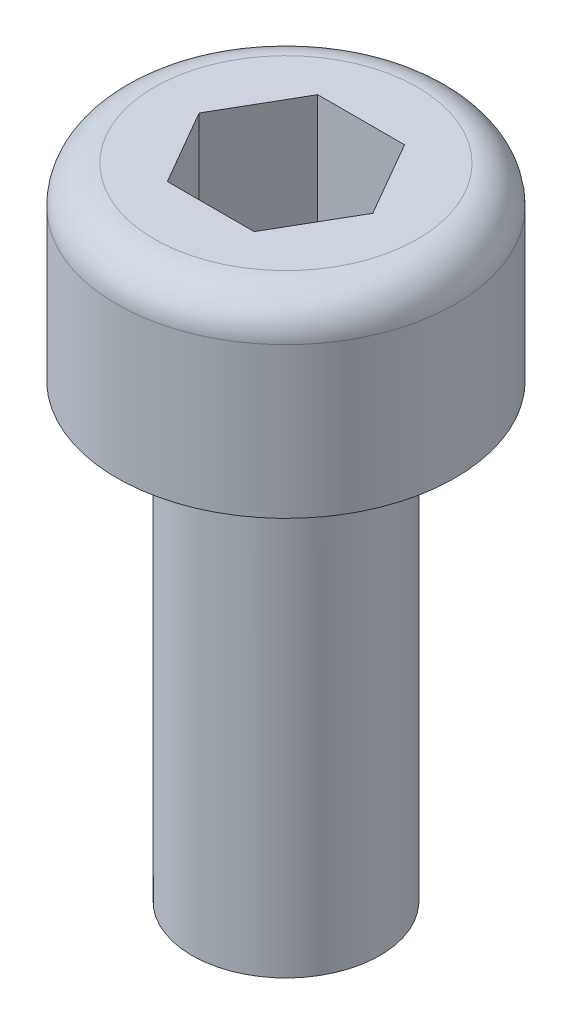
from build123d import *

# Parameters (mm, degrees)
CUT_EXTRUDE1_DEPTH = 2


with BuildPart() as part:
    # Sketch1 → Base-Revolve (revolve)
    with BuildSketch(Plane.XY, mode=Mode.PRIVATE) as base_revolve_sk:
        with BuildLine():
            Line((0, -6.334936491), (0, 2.5))
            Line((0, 2.5), (1.75, 2.5))
            ThreePointArc((1.75, 2.5), (2.103553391, 2.353553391), (2.25, 2))
            Line((2.25, 2), (2.25, 0))
            Line((2.25, 0), (1.25, 0))
            Line((1.25, 0), (1.25, -6))
            Line((1.25, -6), (0, -6.334936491))
        make_face()
    revolve(base_revolve_sk.sketch.rotate(Axis((0, 2.5, 0), (0, 1, 0)), 90), axis=Axis((0, 2.5, 0), (0, 1, 0)))

    # Sketch2 → Cut-Extrude1 (cut)
    with BuildSketch(Plane(origin=(0, 2.5, 0), x_dir=(-1, 0, 0), z_dir=(0, 1, 0))):
        Polygon((-1.154700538, 0), (-0.577350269, -1), (0.577350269, -1), (1.154700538, 0), (0.577350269, 1), (-0.577350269, 1), align=None)
    extrude(amount=-CUT_EXTRUDE1_DEPTH, mode=Mode.SUBTRACT)


solid = part.part
